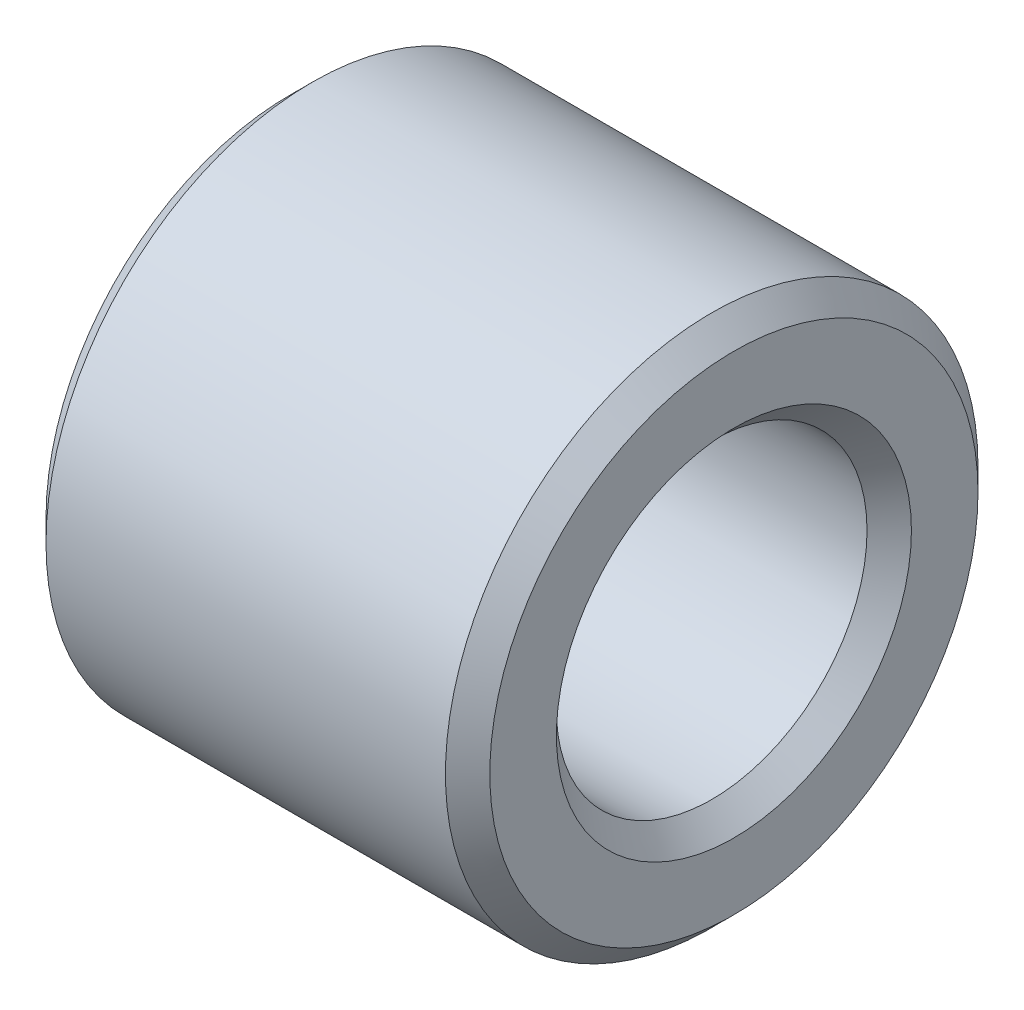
from build123d import *

# Parameters (mm, degrees)
ESQUISSE1_W     = 10
ESQUISSE1_H     = 2.5
CHANFREIN1_SIZE = 0.5


with BuildPart() as part:
    # Esquisse1 → R_volution1 (revolve)
    with BuildSketch(Plane.XY, mode=Mode.PRIVATE) as r_volution1_sk:
        with Locations((-5, 4.75)):
            Rectangle(ESQUISSE1_W, ESQUISSE1_H)
    revolve(r_volution1_sk.sketch.rotate(Axis((0, 0, 0), (-1, 0, 0)), 90), axis=Axis((0, 0, 0), (-1, 0, 0)))

    # Chanfrein1
    chanfrein1_edges = [part.edges().sort_by_distance(p)[0] for p in [
        (0, 0, 3.5),
        (-10, 0, 3.5),
        (-10, 0, 6),
        (0, 0, 6),
    ]]
    chamfer(chanfrein1_edges, length=CHANFREIN1_SIZE)


solid = part.part
